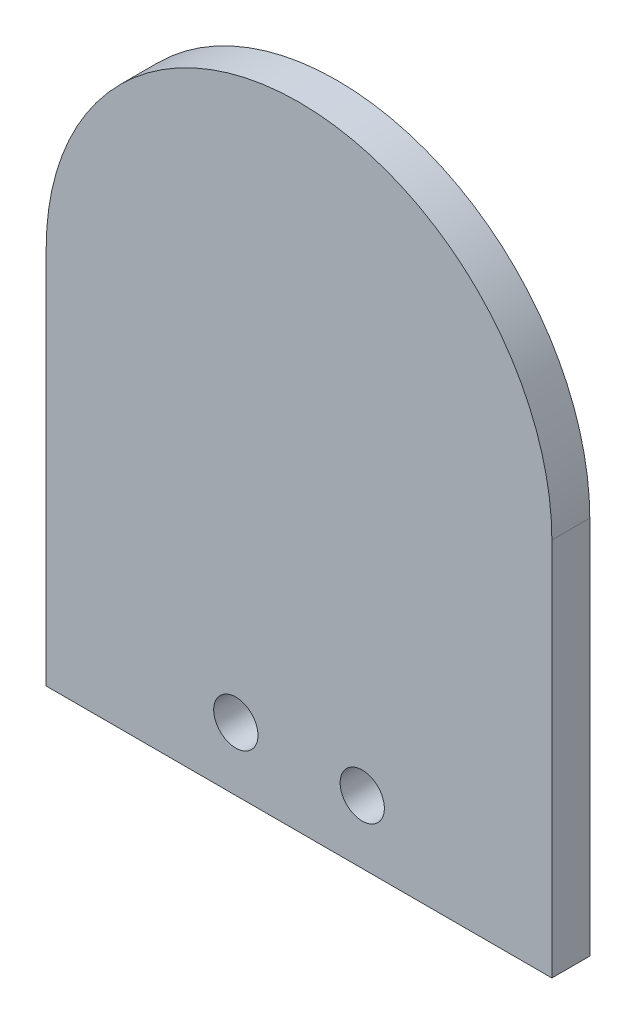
from build123d import *

# Parameters (mm, degrees)
SKETCH1_R      = 1.75
EXTRUDE1_DEPTH = 3


with BuildPart() as part:
    # Sketch1 → Extrude1 (new body)
    with BuildSketch(Plane.XY):
        with BuildLine():
            Line((0, 0), (40, 0))
            Line((40, 0), (40, 30))
            ThreePointArc((40, 30), (20, 50), (0, 30))
            Line((0, 30), (0, 0))
        make_face()
        with Locations((15, 5)):
            Circle(SKETCH1_R, mode=Mode.SUBTRACT)
        with Locations((25, 5)):
            Circle(SKETCH1_R, mode=Mode.SUBTRACT)
    extrude(amount=EXTRUDE1_DEPTH)


solid = part.part
